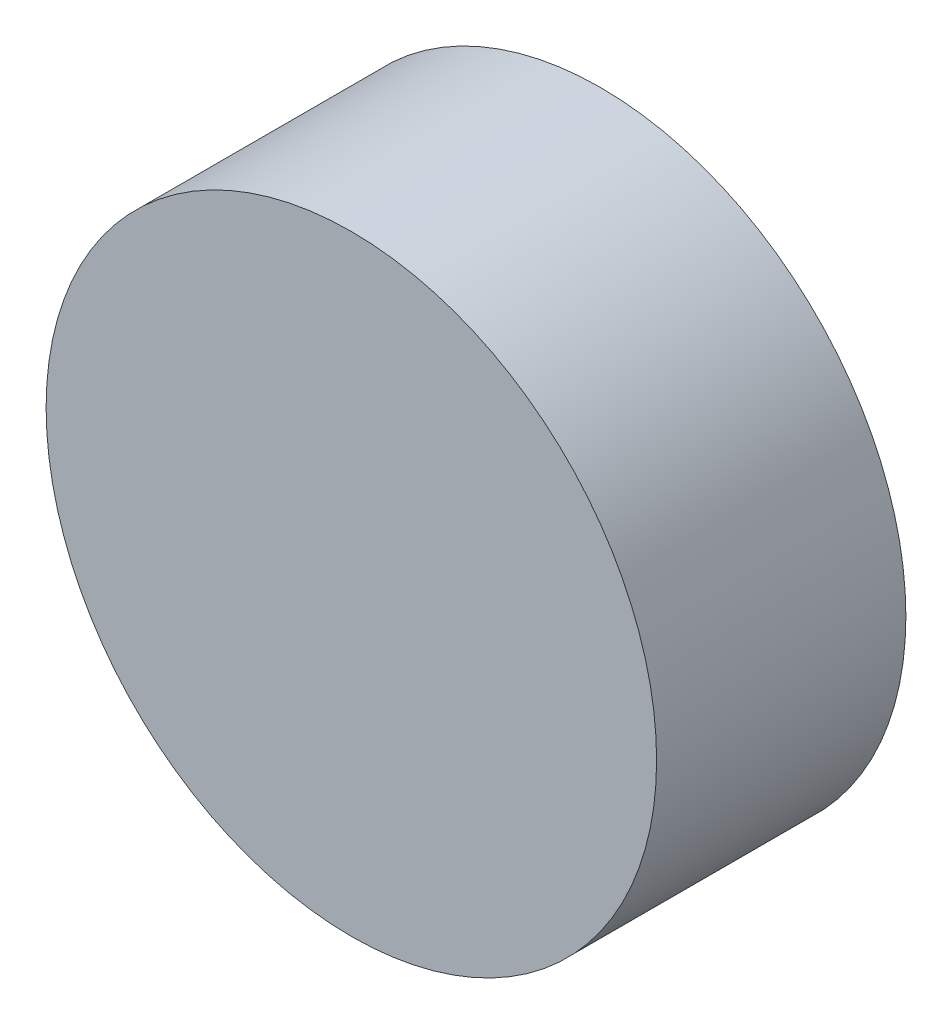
ISO-10303-21;
HEADER;
FILE_DESCRIPTION(('STEP AP214'),'2;1');
FILE_NAME('part.step','',(''),(''),'','','');
FILE_SCHEMA(('AUTOMOTIVE_DESIGN { 1 0 10303 214 1 1 1 1 }'));
ENDSEC;
DATA;
#1=APPLICATION_CONTEXT('core data for automotive mechanical design processes');
#2=APPLICATION_PROTOCOL_DEFINITION('international standard','automotive_design',2000,#1);
#3=PRODUCT_CONTEXT('',#1,'mechanical');
#4=PRODUCT('Part','Part','',(#3));
#5=PRODUCT_RELATED_PRODUCT_CATEGORY('part','',(#4));
#6=PRODUCT_DEFINITION_FORMATION('','',#4);
#7=PRODUCT_DEFINITION_CONTEXT('part definition',#1,'design');
#8=PRODUCT_DEFINITION('design','',#6,#7);
#9=PRODUCT_DEFINITION_SHAPE('','',#8);
#10=(LENGTH_UNIT() NAMED_UNIT(*) SI_UNIT(.MILLI.,.METRE.));
#11=(NAMED_UNIT(*) PLANE_ANGLE_UNIT() SI_UNIT($,.RADIAN.));
#12=(NAMED_UNIT(*) SI_UNIT($,.STERADIAN.) SOLID_ANGLE_UNIT());
#13=UNCERTAINTY_MEASURE_WITH_UNIT(LENGTH_MEASURE(1.E-05),#10,'distance_accuracy_value','');
#14=(GEOMETRIC_REPRESENTATION_CONTEXT(3) GLOBAL_UNCERTAINTY_ASSIGNED_CONTEXT((#13)) GLOBAL_UNIT_ASSIGNED_CONTEXT((#10,
#11,#12)) REPRESENTATION_CONTEXT('',''));
#15=CARTESIAN_POINT('',(0.,0.,0.));
#16=DIRECTION('',(0.,0.,1.));
#17=DIRECTION('',(1.,0.,0.));
#18=AXIS2_PLACEMENT_3D('',#15,#16,#17);
#19=CARTESIAN_POINT('',(0.,0.,6.9));
#20=DIRECTION('',(0.,0.,1.));
#21=DIRECTION('',(1.,0.,0.));
#22=AXIS2_PLACEMENT_3D('',#19,#20,#21);
#23=PLANE('',#22);
#24=CARTESIAN_POINT('',(0.,0.,6.9));
#25=DIRECTION('',(0.,0.,-1.));
#26=DIRECTION('',(-1.,0.,0.));
#27=AXIS2_PLACEMENT_3D('',#24,#25,#26);
#28=CIRCLE('',#27,16.9);
#29=CARTESIAN_POINT('',(-16.9,0.,6.9));
#30=VERTEX_POINT('',#29);
#31=EDGE_CURVE('E10',#30,#30,#28,.T.);
#32=ORIENTED_EDGE('',*,*,#31,.F.);
#33=EDGE_LOOP('',(#32));
#34=FACE_BOUND('',#33,.T.);
#35=ADVANCED_FACE('F15',(#34),#23,.T.);
#36=CARTESIAN_POINT('',(0.,0.,-6.9));
#37=DIRECTION('',(0.,0.,-1.));
#38=DIRECTION('',(-1.,0.,0.));
#39=AXIS2_PLACEMENT_3D('',#36,#37,#38);
#40=PLANE('',#39);
#41=CARTESIAN_POINT('',(0.,0.,-6.9));
#42=DIRECTION('',(0.,0.,1.));
#43=DIRECTION('',(1.,0.,0.));
#44=AXIS2_PLACEMENT_3D('',#41,#42,#43);
#45=CIRCLE('',#44,16.9);
#46=CARTESIAN_POINT('',(16.9,0.,-6.9));
#47=VERTEX_POINT('',#46);
#48=EDGE_CURVE('E22',#47,#47,#45,.T.);
#49=ORIENTED_EDGE('',*,*,#48,.F.);
#50=EDGE_LOOP('',(#49));
#51=FACE_BOUND('',#50,.T.);
#52=ADVANCED_FACE('F26',(#51),#40,.T.);
#53=CARTESIAN_POINT('',(0.,0.,-6.9));
#54=DIRECTION('',(0.,0.,1.));
#55=DIRECTION('',(1.,0.,0.));
#56=AXIS2_PLACEMENT_3D('',#53,#54,#55);
#57=CYLINDRICAL_SURFACE('',#56,16.9);
#58=ORIENTED_EDGE('',*,*,#31,.T.);
#59=EDGE_LOOP('',(#58));
#60=FACE_BOUND('',#59,.T.);
#61=ORIENTED_EDGE('',*,*,#48,.T.);
#62=EDGE_LOOP('',(#61));
#63=FACE_BOUND('',#62,.T.);
#64=ADVANCED_FACE('F17',(#60,#63),#57,.T.);
#65=CLOSED_SHELL('',(#35,#52,#64));
#66=MANIFOLD_SOLID_BREP('B1',#65);
#67=ADVANCED_BREP_SHAPE_REPRESENTATION('',(#18,#66),#14);
#68=SHAPE_DEFINITION_REPRESENTATION(#9,#67);
ENDSEC;
END-ISO-10303-21;
